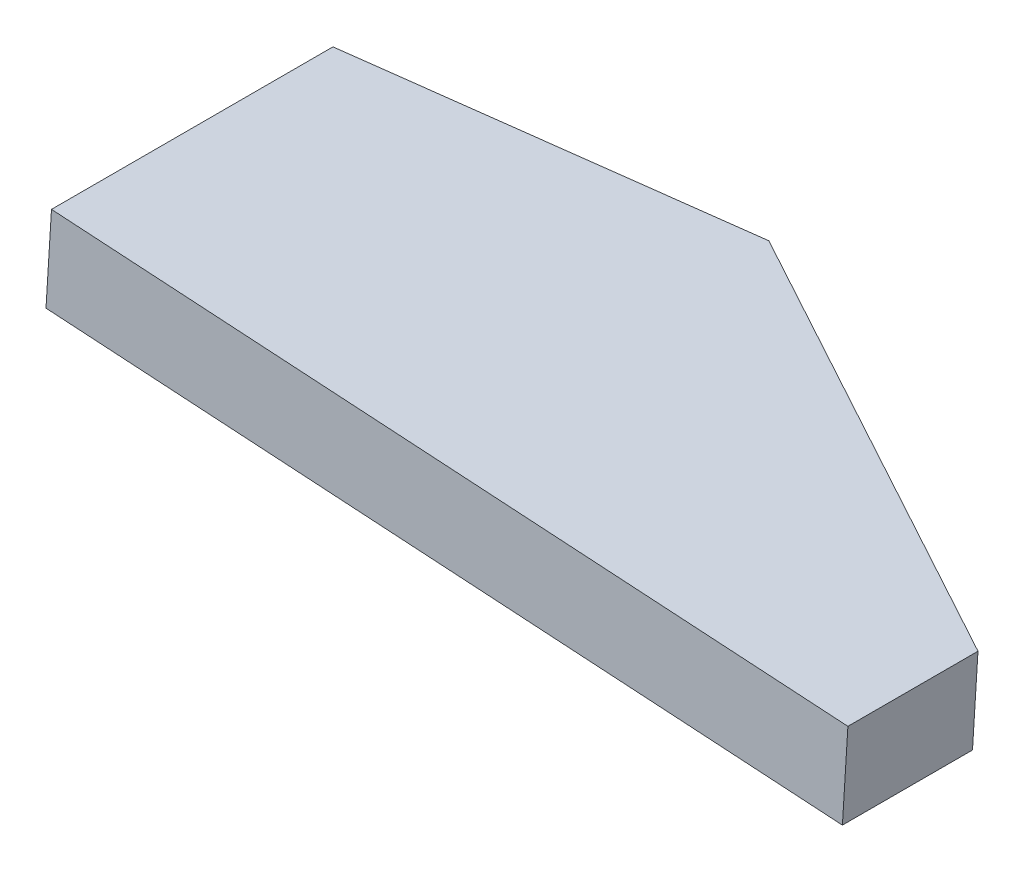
ISO-10303-21;
HEADER;
FILE_DESCRIPTION(('STEP AP214'),'2;1');
FILE_NAME('part.step','',(''),(''),'','','');
FILE_SCHEMA(('AUTOMOTIVE_DESIGN { 1 0 10303 214 1 1 1 1 }'));
ENDSEC;
DATA;
#1=APPLICATION_CONTEXT('core data for automotive mechanical design processes');
#2=APPLICATION_PROTOCOL_DEFINITION('international standard','automotive_design',2000,#1);
#3=PRODUCT_CONTEXT('',#1,'mechanical');
#4=PRODUCT('Part','Part','',(#3));
#5=PRODUCT_RELATED_PRODUCT_CATEGORY('part','',(#4));
#6=PRODUCT_DEFINITION_FORMATION('','',#4);
#7=PRODUCT_DEFINITION_CONTEXT('part definition',#1,'design');
#8=PRODUCT_DEFINITION('design','',#6,#7);
#9=PRODUCT_DEFINITION_SHAPE('','',#8);
#10=(LENGTH_UNIT() NAMED_UNIT(*) SI_UNIT(.MILLI.,.METRE.));
#11=(NAMED_UNIT(*) PLANE_ANGLE_UNIT() SI_UNIT($,.RADIAN.));
#12=(NAMED_UNIT(*) SI_UNIT($,.STERADIAN.) SOLID_ANGLE_UNIT());
#13=UNCERTAINTY_MEASURE_WITH_UNIT(LENGTH_MEASURE(1.E-05),#10,'distance_accuracy_value','');
#14=(GEOMETRIC_REPRESENTATION_CONTEXT(3) GLOBAL_UNCERTAINTY_ASSIGNED_CONTEXT((#13)) GLOBAL_UNIT_ASSIGNED_CONTEXT((#10,
#11,#12)) REPRESENTATION_CONTEXT('',''));
#15=CARTESIAN_POINT('',(0.,0.,0.));
#16=DIRECTION('',(0.,0.,1.));
#17=DIRECTION('',(1.,0.,0.));
#18=AXIS2_PLACEMENT_3D('',#15,#16,#17);
#19=CARTESIAN_POINT('',(-173.285159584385,-41.7016497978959,-31.8000000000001));
#20=DIRECTION('',(-0.998074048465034,0.0620338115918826,0.));
#21=DIRECTION('',(0.,0.,1.));
#22=AXIS2_PLACEMENT_3D('',#19,#20,#21);
#23=PLANE('',#22);
#24=DIRECTION('',(0.0620338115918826,0.998074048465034,0.));
#25=VECTOR('',#24,1.);
#26=CARTESIAN_POINT('',(-173.285159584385,-41.7016497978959,-31.8000000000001));
#27=LINE('',#26,#25);
#28=CARTESIAN_POINT('',(-173.905497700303,-51.6823902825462,-31.8000000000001));
#29=VERTEX_POINT('',#28);
#30=CARTESIAN_POINT('',(-173.285159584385,-41.7016497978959,-31.8000000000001));
#31=VERTEX_POINT('',#30);
#32=EDGE_CURVE('E63',#29,#31,#27,.T.);
#33=ORIENTED_EDGE('',*,*,#32,.F.);
#34=DIRECTION('',(0.,0.,1.));
#35=VECTOR('',#34,1.);
#36=CARTESIAN_POINT('',(-173.905497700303,-51.6823902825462,-20.0000000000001));
#37=LINE('',#36,#35);
#38=CARTESIAN_POINT('',(-173.905497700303,-51.6823902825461,0.));
#39=VERTEX_POINT('',#38);
#40=EDGE_CURVE('E127',#29,#39,#37,.T.);
#41=ORIENTED_EDGE('',*,*,#40,.T.);
#42=DIRECTION('',(0.0620338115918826,0.998074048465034,0.));
#43=VECTOR('',#42,1.);
#44=CARTESIAN_POINT('',(-173.285159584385,-41.7016497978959,0.));
#45=LINE('',#44,#43);
#46=CARTESIAN_POINT('',(-173.285159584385,-41.7016497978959,0.));
#47=VERTEX_POINT('',#46);
#48=EDGE_CURVE('E71',#39,#47,#45,.T.);
#49=ORIENTED_EDGE('',*,*,#48,.T.);
#50=DIRECTION('',(0.,0.,1.));
#51=VECTOR('',#50,1.);
#52=CARTESIAN_POINT('',(-173.285159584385,-41.7016497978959,-31.8000000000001));
#53=LINE('',#52,#51);
#54=EDGE_CURVE('E122',#31,#47,#53,.T.);
#55=ORIENTED_EDGE('',*,*,#54,.F.);
#56=EDGE_LOOP('',(#33,#41,#49,#55));
#57=FACE_BOUND('',#56,.T.);
#58=ADVANCED_FACE('F53',(#57),#23,.T.);
#59=CARTESIAN_POINT('',(-152.761085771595,-42.9772931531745,-20.0000000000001));
#60=DIRECTION('',(0.0620338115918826,0.998074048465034,0.));
#61=DIRECTION('',(-0.998074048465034,0.0620338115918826,0.));
#62=AXIS2_PLACEMENT_3D('',#59,#60,#61);
#63=PLANE('',#62);
#64=DIRECTION('',(0.998074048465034,-0.0620338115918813,0.));
#65=VECTOR('',#64,1.);
#66=CARTESIAN_POINT('',(-173.285159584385,-41.7016497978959,0.));
#67=LINE('',#66,#65);
#68=CARTESIAN_POINT('',(-83.3064345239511,-47.2941439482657,0.));
#69=VERTEX_POINT('',#68);
#70=EDGE_CURVE('E145',#47,#69,#67,.T.);
#71=ORIENTED_EDGE('',*,*,#70,.T.);
#72=DIRECTION('',(0.,0.,-1.));
#73=VECTOR('',#72,1.);
#74=CARTESIAN_POINT('',(-83.3064345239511,-47.2941439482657,0.));
#75=LINE('',#74,#73);
#76=CARTESIAN_POINT('',(-83.3064345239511,-47.2941439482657,-14.7));
#77=VERTEX_POINT('',#76);
#78=EDGE_CURVE('E130',#69,#77,#75,.T.);
#79=ORIENTED_EDGE('',*,*,#78,.T.);
#80=DIRECTION('',(-0.886932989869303,0.0551260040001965,-0.458596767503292));
#81=VECTOR('',#80,1.);
#82=CARTESIAN_POINT('',(-83.3064345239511,-47.2941439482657,-14.7));
#83=LINE('',#82,#81);
#84=CARTESIAN_POINT('',(-132.237011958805,-44.2529365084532,-40.));
#85=VERTEX_POINT('',#84);
#86=EDGE_CURVE('E125',#77,#85,#83,.T.);
#87=ORIENTED_EDGE('',*,*,#86,.T.);
#88=DIRECTION('',(-0.978808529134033,0.0608363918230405,0.195532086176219));
#89=VECTOR('',#88,1.);
#90=CARTESIAN_POINT('',(-132.237011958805,-44.2529365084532,-40.0000000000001));
#91=LINE('',#90,#89);
#92=EDGE_CURVE('E115',#85,#31,#91,.T.);
#93=ORIENTED_EDGE('',*,*,#92,.T.);
#94=ORIENTED_EDGE('',*,*,#54,.T.);
#95=EDGE_LOOP('',(#71,#79,#87,#93,#94));
#96=FACE_BOUND('',#95,.T.);
#97=ADVANCED_FACE('F129',(#96),#63,.T.);
#98=CARTESIAN_POINT('',(-132.237011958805,-44.2529365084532,-40.0000000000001));
#99=DIRECTION('',(-0.195155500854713,0.0121296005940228,-0.98069730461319));
#100=DIRECTION('',(-0.978808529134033,0.0608363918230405,0.195532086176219));
#101=AXIS2_PLACEMENT_3D('',#98,#99,#100);
#102=PLANE('',#101);
#103=DIRECTION('',(-0.978808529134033,0.0608363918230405,0.195532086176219));
#104=VECTOR('',#103,1.);
#105=CARTESIAN_POINT('',(-132.857350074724,-54.2336769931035,-40.0000000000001));
#106=LINE('',#105,#104);
#107=CARTESIAN_POINT('',(-132.857350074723,-54.2336769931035,-40.0000000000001));
#108=VERTEX_POINT('',#107);
#109=EDGE_CURVE('E91',#108,#29,#106,.T.);
#110=ORIENTED_EDGE('',*,*,#109,.T.);
#111=ORIENTED_EDGE('',*,*,#32,.T.);
#112=ORIENTED_EDGE('',*,*,#92,.F.);
#113=DIRECTION('',(0.0620338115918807,0.998074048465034,0.));
#114=VECTOR('',#113,1.);
#115=CARTESIAN_POINT('',(-132.237011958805,-44.2529365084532,-40.));
#116=LINE('',#115,#114);
#117=EDGE_CURVE('E57',#108,#85,#116,.T.);
#118=ORIENTED_EDGE('',*,*,#117,.F.);
#119=EDGE_LOOP('',(#110,#111,#112,#118));
#120=FACE_BOUND('',#119,.T.);
#121=ADVANCED_FACE('F117',(#120),#102,.T.);
#122=CARTESIAN_POINT('',(-153.381423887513,-52.9580336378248,-20.0000000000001));
#123=DIRECTION('',(0.0620338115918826,0.998074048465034,0.));
#124=DIRECTION('',(-0.998074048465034,0.0620338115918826,0.));
#125=AXIS2_PLACEMENT_3D('',#122,#123,#124);
#126=PLANE('',#125);
#127=ORIENTED_EDGE('',*,*,#109,.F.);
#128=DIRECTION('',(-0.886932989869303,0.0551260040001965,-0.458596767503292));
#129=VECTOR('',#128,1.);
#130=CARTESIAN_POINT('',(-83.9267726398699,-57.274884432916,-14.7));
#131=LINE('',#130,#129);
#132=CARTESIAN_POINT('',(-83.9267726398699,-57.274884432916,-14.7));
#133=VERTEX_POINT('',#132);
#134=EDGE_CURVE('E126',#133,#108,#131,.T.);
#135=ORIENTED_EDGE('',*,*,#134,.F.);
#136=DIRECTION('',(0.,0.,1.));
#137=VECTOR('',#136,1.);
#138=CARTESIAN_POINT('',(-83.9267726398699,-57.274884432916,-7.35000000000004));
#139=LINE('',#138,#137);
#140=CARTESIAN_POINT('',(-83.9267726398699,-57.274884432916,0.));
#141=VERTEX_POINT('',#140);
#142=EDGE_CURVE('E138',#141,#133,#139,.F.);
#143=ORIENTED_EDGE('',*,*,#142,.F.);
#144=DIRECTION('',(-0.998074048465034,0.0620338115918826,0.));
#145=VECTOR('',#144,1.);
#146=CARTESIAN_POINT('',(-153.381423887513,-52.9580336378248,0.));
#147=LINE('',#146,#145);
#148=EDGE_CURVE('E12',#39,#141,#147,.F.);
#149=ORIENTED_EDGE('',*,*,#148,.F.);
#150=ORIENTED_EDGE('',*,*,#40,.F.);
#151=EDGE_LOOP('',(#127,#135,#143,#149,#150));
#152=FACE_BOUND('',#151,.T.);
#153=ADVANCED_FACE('F147',(#152),#126,.F.);
#154=CARTESIAN_POINT('',(-173.285159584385,-41.7016497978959,0.));
#155=DIRECTION('',(0.,0.,1.));
#156=DIRECTION('',(0.998074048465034,-0.0620338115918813,0.));
#157=AXIS2_PLACEMENT_3D('',#154,#155,#156);
#158=PLANE('',#157);
#159=ORIENTED_EDGE('',*,*,#48,.F.);
#160=ORIENTED_EDGE('',*,*,#148,.T.);
#161=DIRECTION('',(0.0620338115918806,0.998074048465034,0.));
#162=VECTOR('',#161,1.);
#163=CARTESIAN_POINT('',(-83.3064345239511,-47.2941439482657,0.));
#164=LINE('',#163,#162);
#165=EDGE_CURVE('E128',#141,#69,#164,.T.);
#166=ORIENTED_EDGE('',*,*,#165,.T.);
#167=ORIENTED_EDGE('',*,*,#70,.F.);
#168=EDGE_LOOP('',(#159,#160,#166,#167));
#169=FACE_BOUND('',#168,.T.);
#170=ADVANCED_FACE('F55',(#169),#158,.T.);
#171=CARTESIAN_POINT('',(-83.3064345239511,-47.2941439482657,0.));
#172=DIRECTION('',(0.998074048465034,-0.0620338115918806,0.));
#173=DIRECTION('',(0.,0.,-1.));
#174=AXIS2_PLACEMENT_3D('',#171,#172,#173);
#175=PLANE('',#174);
#176=ORIENTED_EDGE('',*,*,#165,.F.);
#177=ORIENTED_EDGE('',*,*,#142,.T.);
#178=DIRECTION('',(0.0620338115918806,0.998074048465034,0.));
#179=VECTOR('',#178,1.);
#180=CARTESIAN_POINT('',(-83.3064345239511,-47.2941439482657,-14.7));
#181=LINE('',#180,#179);
#182=EDGE_CURVE('E100',#133,#77,#181,.T.);
#183=ORIENTED_EDGE('',*,*,#182,.T.);
#184=ORIENTED_EDGE('',*,*,#78,.F.);
#185=EDGE_LOOP('',(#176,#177,#183,#184));
#186=FACE_BOUND('',#185,.T.);
#187=ADVANCED_FACE('F153',(#186),#175,.T.);
#188=CARTESIAN_POINT('',(-83.3064345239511,-47.2941439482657,-14.7));
#189=DIRECTION('',(0.457713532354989,-0.0284485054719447,-0.888644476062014));
#190=DIRECTION('',(-0.886932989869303,0.0551260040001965,-0.458596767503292));
#191=AXIS2_PLACEMENT_3D('',#188,#189,#190);
#192=PLANE('',#191);
#193=ORIENTED_EDGE('',*,*,#134,.T.);
#194=ORIENTED_EDGE('',*,*,#117,.T.);
#195=ORIENTED_EDGE('',*,*,#86,.F.);
#196=ORIENTED_EDGE('',*,*,#182,.F.);
#197=EDGE_LOOP('',(#193,#194,#195,#196));
#198=FACE_BOUND('',#197,.T.);
#199=ADVANCED_FACE('F124',(#198),#192,.T.);
#200=CLOSED_SHELL('',(#58,#97,#121,#153,#170,#187,#199));
#201=MANIFOLD_SOLID_BREP('B2',#200);
#202=ADVANCED_BREP_SHAPE_REPRESENTATION('',(#18,#201),#14);
#203=SHAPE_DEFINITION_REPRESENTATION(#9,#202);
ENDSEC;
END-ISO-10303-21;
